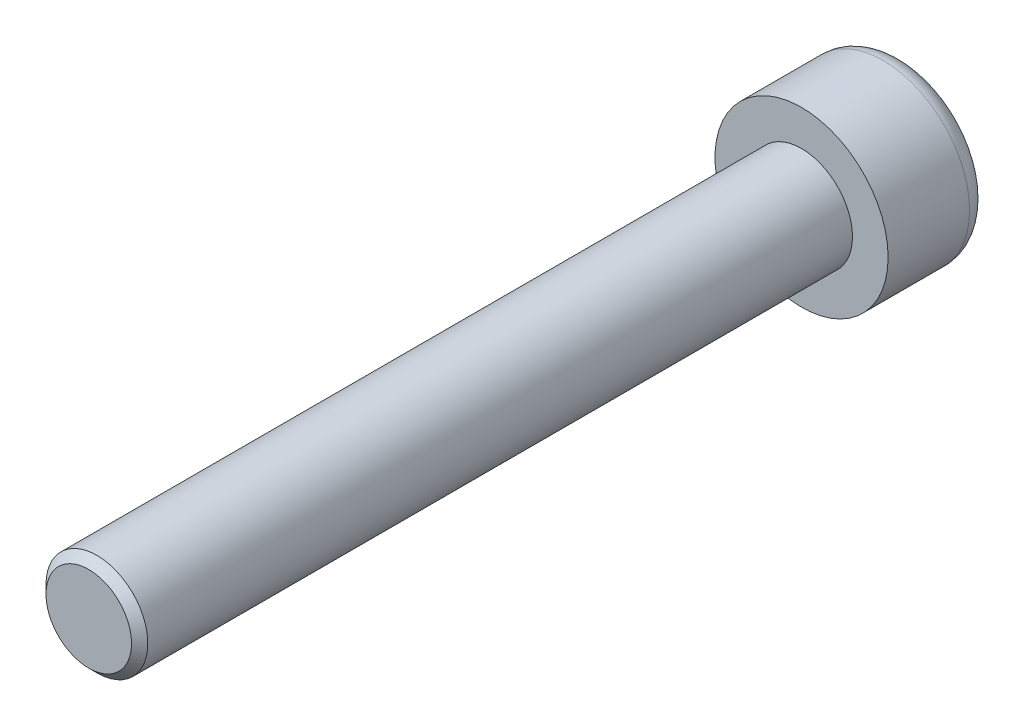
from build123d import *

# Parameters (mm, degrees)
PROFIL_T_TE_R         = 4.25
TETE_DEPTH            = 5
SIX_PANS_DEPTH        = 3.125
CONGE_R               = 1
PROFIL_CYLINDRE_R     = 2.5
CYLINDRE_FILETE_DEPTH = 35


with BuildPart() as part:
    # profil t_te → TETE (new body)
    with BuildSketch(Plane.XY):
        Circle(PROFIL_T_TE_R)
    extrude(amount=TETE_DEPTH)

    # profil six pans → SIX PANS (cut)
    with BuildSketch(Plane(origin=(0, 0, 0), x_dir=(-1, 0, 0), z_dir=(0, 0, -1))):
        Polygon((0, 2.309401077), (-2, 1.154700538), (-2, -1.154700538), (0, -2.309401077), (2, -1.154700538), (2, 1.154700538), align=None)
    extrude(amount=-SIX_PANS_DEPTH, mode=Mode.SUBTRACT)

    # CONGE
    conge_edges = [part.edges().sort_by_distance(p)[0] for p in [
        (-4.25, 0, 0),
    ]]
    fillet(conge_edges, radius=CONGE_R)

    # profil cylindre → CYLINDRE FILETE (add)
    with BuildSketch(Plane.XY.offset(5)):
        Circle(PROFIL_CYLINDRE_R)
    extrude(amount=CYLINDRE_FILETE_DEPTH)

    # profil chanfrein → CHANFREIN FILET (revolve, cut)
    with BuildSketch(Plane(origin=(0, 0, 0), x_dir=(0, 0, -1), z_dir=(1, 0, 0)), mode=Mode.PRIVATE) as chanfrein_filet_sk:
        Polygon((-40, 2.1), (-39.6, 2.5), (-40, 2.5), align=None)
    revolve(chanfrein_filet_sk.sketch.rotate(Axis((0, 0, 12.087417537), (0, 0, 1)), 90), axis=Axis((0, 0, 12.087417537), (0, 0, 1)), mode=Mode.SUBTRACT)


solid = part.part
